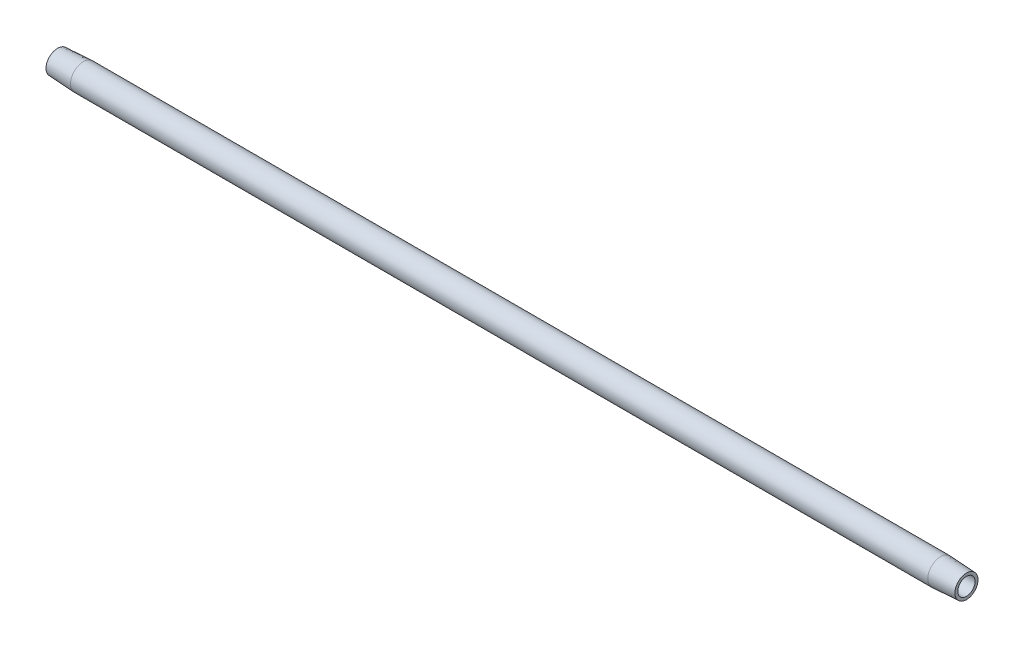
from build123d import *


with BuildPart() as part:
    # Sketch2 → Revolve1 (revolve)
    with BuildSketch(Plane.XY, mode=Mode.PRIVATE) as revolve1_sk:
        Polygon((7.9375, 3.96875), (0, 3.552763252), (0, 2.6543), (279.4, 2.6543), (279.4, 3.552763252), (271.4625, 3.96875), align=None)
    revolve(revolve1_sk.sketch.rotate(Axis((0.476141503, 0, 0), (1, 0, 0)), 90), axis=Axis((0.476141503, 0, 0), (1, 0, 0)))


solid = part.part
